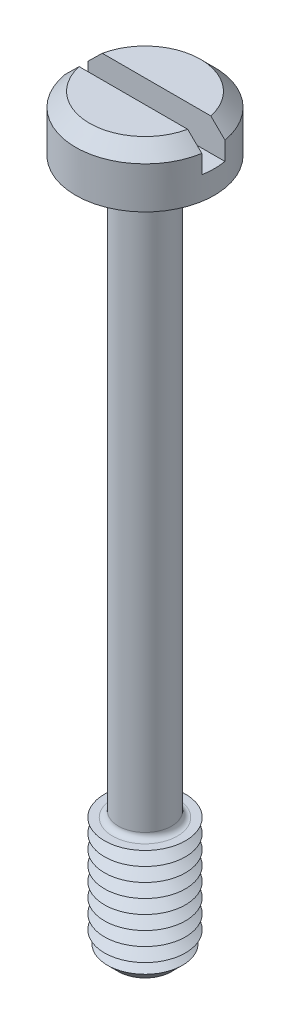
ISO-10303-21;
HEADER;
FILE_DESCRIPTION(('STEP AP214'),'2;1');
FILE_NAME('part.step','',(''),(''),'','','');
FILE_SCHEMA(('AUTOMOTIVE_DESIGN { 1 0 10303 214 1 1 1 1 }'));
ENDSEC;
DATA;
#1=APPLICATION_CONTEXT('core data for automotive mechanical design processes');
#2=APPLICATION_PROTOCOL_DEFINITION('international standard','automotive_design',2000,#1);
#3=PRODUCT_CONTEXT('',#1,'mechanical');
#4=PRODUCT('Part','Part','',(#3));
#5=PRODUCT_RELATED_PRODUCT_CATEGORY('part','',(#4));
#6=PRODUCT_DEFINITION_FORMATION('','',#4);
#7=PRODUCT_DEFINITION_CONTEXT('part definition',#1,'design');
#8=PRODUCT_DEFINITION('design','',#6,#7);
#9=PRODUCT_DEFINITION_SHAPE('','',#8);
#10=(LENGTH_UNIT() NAMED_UNIT(*) SI_UNIT(.MILLI.,.METRE.));
#11=(NAMED_UNIT(*) PLANE_ANGLE_UNIT() SI_UNIT($,.RADIAN.));
#12=(NAMED_UNIT(*) SI_UNIT($,.STERADIAN.) SOLID_ANGLE_UNIT());
#13=UNCERTAINTY_MEASURE_WITH_UNIT(LENGTH_MEASURE(1.E-05),#10,'distance_accuracy_value','');
#14=(GEOMETRIC_REPRESENTATION_CONTEXT(3) GLOBAL_UNCERTAINTY_ASSIGNED_CONTEXT((#13)) GLOBAL_UNIT_ASSIGNED_CONTEXT((#10,
#11,#12)) REPRESENTATION_CONTEXT('',''));
#15=CARTESIAN_POINT('',(0.,0.,0.));
#16=DIRECTION('',(0.,0.,1.));
#17=DIRECTION('',(1.,0.,0.));
#18=AXIS2_PLACEMENT_3D('',#15,#16,#17);
#19=CARTESIAN_POINT('',(0.,2.4,0.));
#20=DIRECTION('',(0.,1.,0.));
#21=DIRECTION('',(0.,0.,1.));
#22=AXIS2_PLACEMENT_3D('',#19,#20,#21);
#23=PLANE('',#22);
#24=DIRECTION('',(-1.,0.,0.));
#25=VECTOR('',#24,1.);
#26=CARTESIAN_POINT('',(3.,2.4,-0.5));
#27=LINE('',#26,#25);
#28=CARTESIAN_POINT('',(2.34733891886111,2.4,-0.5));
#29=VERTEX_POINT('',#28);
#30=CARTESIAN_POINT('',(-2.34733891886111,2.4,-0.5));
#31=VERTEX_POINT('',#30);
#32=EDGE_CURVE('E110',#29,#31,#27,.T.);
#33=ORIENTED_EDGE('',*,*,#32,.F.);
#34=CARTESIAN_POINT('',(0.,2.4,0.));
#35=DIRECTION('',(0.,1.,0.));
#36=DIRECTION('',(0.,0.,1.));
#37=AXIS2_PLACEMENT_3D('',#34,#35,#36);
#38=CIRCLE('',#37,2.40000000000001);
#39=EDGE_CURVE('E113',#29,#31,#38,.T.);
#40=ORIENTED_EDGE('',*,*,#39,.T.);
#41=EDGE_LOOP('',(#33,#40));
#42=FACE_BOUND('',#41,.T.);
#43=ADVANCED_FACE('F39',(#42),#23,.T.);
#44=CARTESIAN_POINT('',(0.,2.4,0.));
#45=DIRECTION('',(0.,-1.,0.));
#46=DIRECTION('',(0.,0.,-1.));
#47=AXIS2_PLACEMENT_3D('',#44,#45,#46);
#48=CONICAL_SURFACE('',#47,2.40000000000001,0.785398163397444);
#49=CARTESIAN_POINT('',(6.59924075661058,-1.81815522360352,-0.5));
#50=CARTESIAN_POINT('',(6.36552831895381,-1.58511655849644,-0.5));
#51=CARTESIAN_POINT('',(6.13178603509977,-1.35210779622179,-0.5));
#52=CARTESIAN_POINT('',(5.66419282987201,-0.886182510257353,-0.5));
#53=CARTESIAN_POINT('',(5.43034190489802,-0.65326599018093,-0.5));
#54=CARTESIAN_POINT('',(4.9622949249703,-0.187370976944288,-0.5));
#55=CARTESIAN_POINT('',(4.72809874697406,0.0456073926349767,-0.5));
#56=CARTESIAN_POINT('',(4.25949632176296,0.51133642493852,-0.5));
#57=CARTESIAN_POINT('',(4.02509008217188,0.744087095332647,-0.5));
#58=CARTESIAN_POINT('',(3.56605462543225,1.19918528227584,-0.5));
#59=CARTESIAN_POINT('',(3.34144041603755,1.42154792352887,-0.5));
#60=CARTESIAN_POINT('',(3.00406693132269,1.75465797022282,-0.5));
#61=CARTESIAN_POINT('',(2.89152775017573,1.86562821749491,-0.5));
#62=CARTESIAN_POINT('',(2.66624137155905,2.08735508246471,-0.5));
#63=CARTESIAN_POINT('',(2.5534941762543,2.19811170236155,-0.5));
#64=CARTESIAN_POINT('',(2.32775708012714,2.41925708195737,-0.5));
#65=CARTESIAN_POINT('',(2.21476734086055,2.52964600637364,-0.5));
#66=CARTESIAN_POINT('',(1.98831594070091,2.74994787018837,-0.5));
#67=CARTESIAN_POINT('',(1.87485426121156,2.85986079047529,-0.5));
#68=CARTESIAN_POINT('',(1.64719242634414,3.07888083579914,-0.5));
#69=CARTESIAN_POINT('',(1.53299241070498,3.18798810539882,-0.5));
#70=CARTESIAN_POINT('',(1.3606375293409,3.3505241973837,-0.5));
#71=CARTESIAN_POINT('',(1.30301197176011,3.40451369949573,-0.5));
#72=CARTESIAN_POINT('',(1.18725070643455,3.51194233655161,-0.5));
#73=CARTESIAN_POINT('',(1.12911501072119,3.56538148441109,-0.5));
#74=CARTESIAN_POINT('',(1.0381044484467,3.64783932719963,-0.5));
#75=CARTESIAN_POINT('',(1.0054935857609,3.67714917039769,-0.5));
#76=CARTESIAN_POINT('',(0.939964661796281,3.73543047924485,-0.5));
#77=CARTESIAN_POINT('',(0.907046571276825,3.76440191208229,-0.5));
#78=CARTESIAN_POINT('',(0.840581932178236,3.82209234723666,-0.5));
#79=CARTESIAN_POINT('',(0.807032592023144,3.8508081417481,-0.5));
#80=CARTESIAN_POINT('',(0.739406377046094,3.90759649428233,-0.5));
#81=CARTESIAN_POINT('',(0.705329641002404,3.93566921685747,-0.5));
#82=CARTESIAN_POINT('',(0.636165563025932,3.99112746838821,-0.5));
#83=CARTESIAN_POINT('',(0.601072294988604,4.01850564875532,-0.5));
#84=CARTESIAN_POINT('',(0.529844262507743,4.07186782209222,-0.5));
#85=CARTESIAN_POINT('',(0.493709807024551,4.09785222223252,-0.5));
#86=CARTESIAN_POINT('',(0.420142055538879,4.14747983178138,-0.5));
#87=CARTESIAN_POINT('',(0.382717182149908,4.17113535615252,-0.5));
#88=CARTESIAN_POINT('',(0.305809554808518,4.21475217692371,-0.5));
#89=CARTESIAN_POINT('',(0.266332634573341,4.23472328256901,-0.5));
#90=CARTESIAN_POINT('',(0.194863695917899,4.2640905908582,-0.5));
#91=CARTESIAN_POINT('',(0.16346702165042,4.27488228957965,-0.5));
#92=CARTESIAN_POINT('',(0.0993951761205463,4.2911465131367,-0.5));
#93=CARTESIAN_POINT('',(0.0667267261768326,4.29664386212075,-0.5));
#94=CARTESIAN_POINT('',(0.000596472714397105,4.30109247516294,-0.5));
#95=CARTESIAN_POINT('',(-0.0328699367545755,4.29998037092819,-0.5));
#96=CARTESIAN_POINT('',(-0.0990204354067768,4.29135963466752,-0.5));
#97=CARTESIAN_POINT('',(-0.131701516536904,4.28382951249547,-0.5));
#98=CARTESIAN_POINT('',(-0.187595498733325,4.26645763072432,-0.5));
#99=CARTESIAN_POINT('',(-0.211151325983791,4.25764794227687,-0.5));
#100=CARTESIAN_POINT('',(-0.257419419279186,4.23801581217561,-0.5));
#101=CARTESIAN_POINT('',(-0.280131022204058,4.22719182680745,-0.5));
#102=CARTESIAN_POINT('',(-0.324887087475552,4.20402808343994,-0.5));
#103=CARTESIAN_POINT('',(-0.346927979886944,4.19168154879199,-0.5));
#104=CARTESIAN_POINT('',(-0.390350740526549,4.16590953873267,-0.5));
#105=CARTESIAN_POINT('',(-0.411732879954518,4.15248451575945,-0.5));
#106=CARTESIAN_POINT('',(-0.48320010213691,4.10572719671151,-0.5));
#107=CARTESIAN_POINT('',(-0.532069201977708,4.07054939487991,-0.5));
#108=CARTESIAN_POINT('',(-0.628034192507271,3.9978371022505,-0.5));
#109=CARTESIAN_POINT('',(-0.675128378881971,3.96030043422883,-0.5));
#110=CARTESIAN_POINT('',(-0.768277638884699,3.8837323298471,-0.5));
#111=CARTESIAN_POINT('',(-0.814329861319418,3.84469743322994,-0.5));
#112=CARTESIAN_POINT('',(-0.905640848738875,3.76575507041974,-0.5));
#113=CARTESIAN_POINT('',(-0.950899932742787,3.72584797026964,-0.5));
#114=CARTESIAN_POINT('',(-1.04097019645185,3.64535266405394,-0.5));
#115=CARTESIAN_POINT('',(-1.08578029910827,3.60476325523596,-0.5));
#116=CARTESIAN_POINT('',(-1.17501433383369,3.52315414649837,-0.5));
#117=CARTESIAN_POINT('',(-1.21943822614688,3.48213440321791,-0.5));
#118=CARTESIAN_POINT('',(-1.35214179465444,3.35874463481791,-0.5));
#119=CARTESIAN_POINT('',(-1.43999477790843,3.27591618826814,-0.5));
#120=CARTESIAN_POINT('',(-1.61421087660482,3.11033648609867,-0.5));
#121=CARTESIAN_POINT('',(-1.70058023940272,3.02759177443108,-0.5));
#122=CARTESIAN_POINT('',(-1.8728892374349,2.86165572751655,-0.5));
#123=CARTESIAN_POINT('',(-1.95882887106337,2.77846439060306,-0.5));
#124=CARTESIAN_POINT('',(-2.21622491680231,2.52844403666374,-0.5));
#125=CARTESIAN_POINT('',(-2.38725269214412,2.36117421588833,-0.5));
#126=CARTESIAN_POINT('',(-2.72882612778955,2.02593191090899,-0.5));
#127=CARTESIAN_POINT('',(-2.89937142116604,1.85795905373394,-0.5));
#128=CARTESIAN_POINT('',(-3.24010524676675,1.52165721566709,-0.5));
#129=CARTESIAN_POINT('',(-3.41029378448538,1.35332824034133,-0.5));
#130=CARTESIAN_POINT('',(-3.7500330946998,1.01685288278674,-0.5));
#131=CARTESIAN_POINT('',(-3.91958441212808,0.848707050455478,-0.5));
#132=CARTESIAN_POINT('',(-4.25853538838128,0.512261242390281,-0.5));
#133=CARTESIAN_POINT('',(-4.42793504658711,0.34396126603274,-0.5));
#134=CARTESIAN_POINT('',(-4.93592097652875,-0.161044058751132,-0.5));
#135=CARTESIAN_POINT('',(-5.27434871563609,-0.497908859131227,-0.5));
#136=CARTESIAN_POINT('',(-5.69486651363,-0.916769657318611,-0.5));
#137=CARTESIAN_POINT('',(-5.77706453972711,-0.998657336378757,-0.5));
#138=CARTESIAN_POINT('',(-5.94145013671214,-1.1624474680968,-0.5));
#139=CARTESIAN_POINT('',(-6.0236377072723,-1.24434992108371,-0.5));
#140=CARTESIAN_POINT('',(-6.18806790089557,-1.40823159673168,-0.5));
#141=CARTESIAN_POINT('',(-6.27031051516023,-1.49021082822,-0.5));
#142=CARTESIAN_POINT('',(-6.43478378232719,-1.65417699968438,-0.5));
#143=CARTESIAN_POINT('',(-6.51701443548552,-1.73616393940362,-0.5));
#144=CARTESIAN_POINT('',(-6.59924075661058,-1.81815522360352,-0.5));
#145=B_SPLINE_CURVE_WITH_KNOTS('',3,(#49,#50,#51,#52,#53,#54,#55,#56,#57,#58,#59,#60,#61,#62,
#63,#64,#65,#66,#67,#68,#69,#70,#71,#72,#73,#74,#75,#76,#77,#78,#79,#80,#81,#82,#83,#84,#85,#86,
#87,#88,#89,#90,#91,#92,#93,#94,#95,#96,#97,#98,#99,#100,#101,#102,#103,#104,#105,#106,#107,
#108,#109,#110,#111,#112,#113,#114,#115,#116,#117,#118,#119,#120,#121,#122,#123,#124,#125,#126,
#127,#128,#129,#130,#131,#132,#133,#134,#135,#136,#137,#138,#139,#140,#141,#142,#143,#144),
.UNSPECIFIED.,.F.,.F.,(4,2,2,2,2,2,2,2,2,2,2,2,2,2,2,2,2,2,2,2,2,2,2,2,2,2,2,2,2,2,2,2,2,2,2,2,
2,2,2,2,2,2,2,2,2,2,2,4),(0.,0.990129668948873,1.98029489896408,2.9713250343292,
3.96232055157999,4.91051293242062,5.38465950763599,5.8588011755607,6.33268991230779,
6.80659750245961,7.28041788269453,7.51731276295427,7.75420207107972,7.88574051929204,
8.01729161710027,8.14976780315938,8.28220970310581,8.41571746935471,8.54918601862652,
8.68190589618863,8.81426715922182,8.91354607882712,9.01235719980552,9.1121171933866,
9.21221254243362,9.28755627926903,9.36295799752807,9.43870832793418,9.51442704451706,
9.69490147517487,9.87554500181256,10.0566343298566,10.2376490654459,10.4190258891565,
10.6004211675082,10.9626397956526,11.3214656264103,11.6802927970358,12.3979711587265,
13.1160968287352,13.8342113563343,14.5505812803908,15.2669541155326,16.6994694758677,
17.0475484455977,17.3956364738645,17.7440040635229,18.0923625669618),.UNSPECIFIED.);
#146=CARTESIAN_POINT('',(2.95803989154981,1.8,-0.5));
#147=VERTEX_POINT('',#146);
#148=EDGE_CURVE('E260',#147,#29,#145,.T.);
#149=ORIENTED_EDGE('',*,*,#148,.F.);
#150=CARTESIAN_POINT('',(0.,1.8,0.));
#151=DIRECTION('',(0.,1.,0.));
#152=DIRECTION('',(0.,0.,1.));
#153=AXIS2_PLACEMENT_3D('',#150,#151,#152);
#154=CIRCLE('',#153,3.);
#155=CARTESIAN_POINT('',(-2.95803989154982,1.8,-0.5));
#156=VERTEX_POINT('',#155);
#157=EDGE_CURVE('E128',#156,#147,#154,.F.);
#158=ORIENTED_EDGE('',*,*,#157,.F.);
#159=EDGE_CURVE('E102',#31,#156,#145,.T.);
#160=ORIENTED_EDGE('',*,*,#159,.F.);
#161=ORIENTED_EDGE('',*,*,#39,.F.);
#162=EDGE_LOOP('',(#149,#158,#160,#161));
#163=FACE_BOUND('',#162,.T.);
#164=ADVANCED_FACE('F222',(#163),#48,.T.);
#165=CARTESIAN_POINT('',(0.,-30.,0.));
#166=DIRECTION('',(0.,1.,0.));
#167=DIRECTION('',(0.,0.,1.));
#168=AXIS2_PLACEMENT_3D('',#165,#166,#167);
#169=CYLINDRICAL_SURFACE('',#168,1.15);
#170=CARTESIAN_POINT('',(0.,-24.55,0.));
#171=DIRECTION('',(0.,-1.,0.));
#172=DIRECTION('',(0.,0.,-1.));
#173=AXIS2_PLACEMENT_3D('',#170,#171,#172);
#174=CIRCLE('',#173,1.15);
#175=CARTESIAN_POINT('',(0.,-24.55,-1.15));
#176=VERTEX_POINT('',#175);
#177=EDGE_CURVE('E123',#176,#176,#174,.F.);
#178=ORIENTED_EDGE('',*,*,#177,.T.);
#179=EDGE_LOOP('',(#178));
#180=FACE_BOUND('',#179,.T.);
#181=CARTESIAN_POINT('',(0.,-0.25,0.));
#182=DIRECTION('',(0.,1.,0.));
#183=DIRECTION('',(0.,0.,1.));
#184=AXIS2_PLACEMENT_3D('',#181,#182,#183);
#185=CIRCLE('',#184,1.15);
#186=CARTESIAN_POINT('',(0.,-0.25,1.15));
#187=VERTEX_POINT('',#186);
#188=EDGE_CURVE('E366',#187,#187,#185,.F.);
#189=ORIENTED_EDGE('',*,*,#188,.T.);
#190=EDGE_LOOP('',(#189));
#191=FACE_BOUND('',#190,.T.);
#192=ADVANCED_FACE('F218',(#180,#191),#169,.T.);
#193=CARTESIAN_POINT('',(0.,2.4,0.));
#194=DIRECTION('',(0.,-1.,0.));
#195=DIRECTION('',(0.,0.,-1.));
#196=AXIS2_PLACEMENT_3D('',#193,#194,#195);
#197=CYLINDRICAL_SURFACE('',#196,3.);
#198=ORIENTED_EDGE('',*,*,#157,.T.);
#199=DIRECTION('',(0.,-1.,0.));
#200=VECTOR('',#199,1.);
#201=CARTESIAN_POINT('',(2.95803989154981,2.4,-0.5));
#202=LINE('',#201,#200);
#203=CARTESIAN_POINT('',(2.95803989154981,1.,-0.5));
#204=VERTEX_POINT('',#203);
#205=EDGE_CURVE('E64',#147,#204,#202,.T.);
#206=ORIENTED_EDGE('',*,*,#205,.T.);
#207=CARTESIAN_POINT('',(0.,1.,0.));
#208=DIRECTION('',(0.,1.,0.));
#209=DIRECTION('',(0.,0.,1.));
#210=AXIS2_PLACEMENT_3D('',#207,#208,#209);
#211=CIRCLE('',#210,3.);
#212=CARTESIAN_POINT('',(2.95803989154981,1.,0.5));
#213=VERTEX_POINT('',#212);
#214=EDGE_CURVE('E11',#213,#204,#211,.T.);
#215=ORIENTED_EDGE('',*,*,#214,.F.);
#216=DIRECTION('',(0.,-1.,0.));
#217=VECTOR('',#216,1.);
#218=CARTESIAN_POINT('',(2.95803989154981,2.4,0.5));
#219=LINE('',#218,#217);
#220=CARTESIAN_POINT('',(2.95803989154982,1.8,0.5));
#221=VERTEX_POINT('',#220);
#222=EDGE_CURVE('E278',#213,#221,#219,.F.);
#223=ORIENTED_EDGE('',*,*,#222,.T.);
#224=CARTESIAN_POINT('',(-2.95803989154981,1.8,0.5));
#225=VERTEX_POINT('',#224);
#226=EDGE_CURVE('E120',#221,#225,#154,.F.);
#227=ORIENTED_EDGE('',*,*,#226,.T.);
#228=DIRECTION('',(0.,-1.,0.));
#229=VECTOR('',#228,1.);
#230=CARTESIAN_POINT('',(-2.95803989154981,2.4,0.5));
#231=LINE('',#230,#229);
#232=CARTESIAN_POINT('',(-2.95803989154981,1.,0.5));
#233=VERTEX_POINT('',#232);
#234=EDGE_CURVE('E96',#225,#233,#231,.T.);
#235=ORIENTED_EDGE('',*,*,#234,.T.);
#236=CARTESIAN_POINT('',(-2.95803989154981,1.,-0.5));
#237=VERTEX_POINT('',#236);
#238=EDGE_CURVE('E44',#237,#233,#211,.T.);
#239=ORIENTED_EDGE('',*,*,#238,.F.);
#240=DIRECTION('',(0.,-1.,0.));
#241=VECTOR('',#240,1.);
#242=CARTESIAN_POINT('',(-2.95803989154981,2.4,-0.5));
#243=LINE('',#242,#241);
#244=EDGE_CURVE('E283',#237,#156,#243,.F.);
#245=ORIENTED_EDGE('',*,*,#244,.T.);
#246=EDGE_LOOP('',(#198,#206,#215,#223,#227,#235,#239,#245));
#247=FACE_BOUND('',#246,.T.);
#248=CARTESIAN_POINT('',(0.,0.,0.));
#249=DIRECTION('',(0.,1.,0.));
#250=DIRECTION('',(0.,0.,1.));
#251=AXIS2_PLACEMENT_3D('',#248,#249,#250);
#252=CIRCLE('',#251,3.);
#253=CARTESIAN_POINT('',(0.,0.,3.));
#254=VERTEX_POINT('',#253);
#255=EDGE_CURVE('E353',#254,#254,#252,.T.);
#256=ORIENTED_EDGE('',*,*,#255,.T.);
#257=EDGE_LOOP('',(#256));
#258=FACE_BOUND('',#257,.T.);
#259=ADVANCED_FACE('F221',(#247,#258),#197,.T.);
#260=DIRECTION('',(1.,0.,0.));
#261=VECTOR('',#260,1.);
#262=CARTESIAN_POINT('',(3.,2.4,0.5));
#263=LINE('',#262,#261);
#264=CARTESIAN_POINT('',(-2.34733891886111,2.4,0.5));
#265=VERTEX_POINT('',#264);
#266=CARTESIAN_POINT('',(2.34733891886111,2.4,0.5));
#267=VERTEX_POINT('',#266);
#268=EDGE_CURVE('E56',#265,#267,#263,.T.);
#269=ORIENTED_EDGE('',*,*,#268,.F.);
#270=EDGE_CURVE('E108',#265,#267,#38,.T.);
#271=ORIENTED_EDGE('',*,*,#270,.T.);
#272=EDGE_LOOP('',(#269,#271));
#273=FACE_BOUND('',#272,.T.);
#274=ADVANCED_FACE('F107',(#273),#23,.T.);
#275=CARTESIAN_POINT('',(0.,0.,0.));
#276=DIRECTION('',(0.,1.,0.));
#277=DIRECTION('',(0.,0.,1.));
#278=AXIS2_PLACEMENT_3D('',#275,#276,#277);
#279=PLANE('',#278);
#280=CARTESIAN_POINT('',(0.,0.,0.));
#281=DIRECTION('',(0.,1.,0.));
#282=DIRECTION('',(0.,0.,1.));
#283=AXIS2_PLACEMENT_3D('',#280,#281,#282);
#284=CIRCLE('',#283,1.4);
#285=CARTESIAN_POINT('',(0.,0.,1.4));
#286=VERTEX_POINT('',#285);
#287=EDGE_CURVE('E114',#286,#286,#284,.T.);
#288=ORIENTED_EDGE('',*,*,#287,.T.);
#289=EDGE_LOOP('',(#288));
#290=FACE_BOUND('',#289,.T.);
#291=ORIENTED_EDGE('',*,*,#255,.F.);
#292=EDGE_LOOP('',(#291));
#293=FACE_BOUND('',#292,.T.);
#294=ADVANCED_FACE('F212',(#290,#293),#279,.F.);
#295=CARTESIAN_POINT('',(0.,-24.8,0.));
#296=DIRECTION('',(0.,-1.,0.));
#297=DIRECTION('',(0.,0.,-1.));
#298=AXIS2_PLACEMENT_3D('',#295,#296,#297);
#299=PLANE('',#298);
#300=CARTESIAN_POINT('',(0.,-24.8,0.));
#301=DIRECTION('',(0.,-1.,0.));
#302=DIRECTION('',(0.,0.,-1.));
#303=AXIS2_PLACEMENT_3D('',#300,#301,#302);
#304=CIRCLE('',#303,1.4);
#305=CARTESIAN_POINT('',(0.,-24.8,-1.4));
#306=VERTEX_POINT('',#305);
#307=EDGE_CURVE('E360',#306,#306,#304,.T.);
#308=ORIENTED_EDGE('',*,*,#307,.T.);
#309=EDGE_LOOP('',(#308));
#310=FACE_BOUND('',#309,.T.);
#311=CARTESIAN_POINT('',(0.,-24.8,0.));
#312=DIRECTION('',(0.,1.,0.));
#313=DIRECTION('',(0.,0.,1.));
#314=AXIS2_PLACEMENT_3D('',#311,#312,#313);
#315=CIRCLE('',#314,1.75);
#316=CARTESIAN_POINT('',(0.,-24.8,1.75));
#317=VERTEX_POINT('',#316);
#318=EDGE_CURVE('E349',#317,#317,#315,.T.);
#319=ORIENTED_EDGE('',*,*,#318,.T.);
#320=EDGE_LOOP('',(#319));
#321=FACE_BOUND('',#320,.T.);
#322=ADVANCED_FACE('F208',(#310,#321),#299,.F.);
#323=CARTESIAN_POINT('',(0.,-25.1,0.));
#324=DIRECTION('',(0.,1.,0.));
#325=DIRECTION('',(0.,0.,1.));
#326=AXIS2_PLACEMENT_3D('',#323,#324,#325);
#327=CONICAL_SURFACE('',#326,1.23038475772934,1.0471975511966);
#328=ORIENTED_EDGE('',*,*,#318,.F.);
#329=EDGE_LOOP('',(#328));
#330=FACE_BOUND('',#329,.T.);
#331=CARTESIAN_POINT('',(0.,-25.1,0.));
#332=DIRECTION('',(0.,1.,0.));
#333=DIRECTION('',(0.,0.,1.));
#334=AXIS2_PLACEMENT_3D('',#331,#332,#333);
#335=CIRCLE('',#334,1.23038475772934);
#336=CARTESIAN_POINT('',(0.,-25.1,1.23038475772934));
#337=VERTEX_POINT('',#336);
#338=EDGE_CURVE('E346',#337,#337,#335,.T.);
#339=ORIENTED_EDGE('',*,*,#338,.T.);
#340=EDGE_LOOP('',(#339));
#341=FACE_BOUND('',#340,.T.);
#342=ADVANCED_FACE('F204',(#330,#341),#327,.T.);
#343=CARTESIAN_POINT('',(0.,-25.4,0.));
#344=DIRECTION('',(0.,-1.,0.));
#345=DIRECTION('',(0.,0.,-1.));
#346=AXIS2_PLACEMENT_3D('',#343,#344,#345);
#347=CONICAL_SURFACE('',#346,1.75,1.0471975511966);
#348=ORIENTED_EDGE('',*,*,#338,.F.);
#349=EDGE_LOOP('',(#348));
#350=FACE_BOUND('',#349,.T.);
#351=CARTESIAN_POINT('',(0.,-25.4,0.));
#352=DIRECTION('',(0.,1.,0.));
#353=DIRECTION('',(0.,0.,1.));
#354=AXIS2_PLACEMENT_3D('',#351,#352,#353);
#355=CIRCLE('',#354,1.75);
#356=CARTESIAN_POINT('',(0.,-25.4,1.75));
#357=VERTEX_POINT('',#356);
#358=EDGE_CURVE('E342',#357,#357,#355,.T.);
#359=ORIENTED_EDGE('',*,*,#358,.T.);
#360=EDGE_LOOP('',(#359));
#361=FACE_BOUND('',#360,.T.);
#362=ADVANCED_FACE('F200',(#350,#361),#347,.T.);
#363=CARTESIAN_POINT('',(0.,-25.7,0.));
#364=DIRECTION('',(0.,1.,0.));
#365=DIRECTION('',(0.,0.,1.));
#366=AXIS2_PLACEMENT_3D('',#363,#364,#365);
#367=CONICAL_SURFACE('',#366,1.23038475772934,1.0471975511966);
#368=ORIENTED_EDGE('',*,*,#358,.F.);
#369=EDGE_LOOP('',(#368));
#370=FACE_BOUND('',#369,.T.);
#371=CARTESIAN_POINT('',(0.,-25.7,0.));
#372=DIRECTION('',(0.,1.,0.));
#373=DIRECTION('',(0.,0.,1.));
#374=AXIS2_PLACEMENT_3D('',#371,#372,#373);
#375=CIRCLE('',#374,1.23038475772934);
#376=CARTESIAN_POINT('',(0.,-25.7,1.23038475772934));
#377=VERTEX_POINT('',#376);
#378=EDGE_CURVE('E338',#377,#377,#375,.T.);
#379=ORIENTED_EDGE('',*,*,#378,.T.);
#380=EDGE_LOOP('',(#379));
#381=FACE_BOUND('',#380,.T.);
#382=ADVANCED_FACE('F196',(#370,#381),#367,.T.);
#383=CARTESIAN_POINT('',(0.,-26.,0.));
#384=DIRECTION('',(0.,-1.,0.));
#385=DIRECTION('',(0.,0.,-1.));
#386=AXIS2_PLACEMENT_3D('',#383,#384,#385);
#387=CONICAL_SURFACE('',#386,1.75,1.0471975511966);
#388=ORIENTED_EDGE('',*,*,#378,.F.);
#389=EDGE_LOOP('',(#388));
#390=FACE_BOUND('',#389,.T.);
#391=CARTESIAN_POINT('',(0.,-26.,0.));
#392=DIRECTION('',(0.,1.,0.));
#393=DIRECTION('',(0.,0.,1.));
#394=AXIS2_PLACEMENT_3D('',#391,#392,#393);
#395=CIRCLE('',#394,1.75);
#396=CARTESIAN_POINT('',(0.,-26.,1.75));
#397=VERTEX_POINT('',#396);
#398=EDGE_CURVE('E334',#397,#397,#395,.T.);
#399=ORIENTED_EDGE('',*,*,#398,.T.);
#400=EDGE_LOOP('',(#399));
#401=FACE_BOUND('',#400,.T.);
#402=ADVANCED_FACE('F192',(#390,#401),#387,.T.);
#403=CARTESIAN_POINT('',(0.,-26.3,0.));
#404=DIRECTION('',(0.,1.,0.));
#405=DIRECTION('',(0.,0.,1.));
#406=AXIS2_PLACEMENT_3D('',#403,#404,#405);
#407=CONICAL_SURFACE('',#406,1.23038475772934,1.0471975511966);
#408=ORIENTED_EDGE('',*,*,#398,.F.);
#409=EDGE_LOOP('',(#408));
#410=FACE_BOUND('',#409,.T.);
#411=CARTESIAN_POINT('',(0.,-26.3,0.));
#412=DIRECTION('',(0.,1.,0.));
#413=DIRECTION('',(0.,0.,1.));
#414=AXIS2_PLACEMENT_3D('',#411,#412,#413);
#415=CIRCLE('',#414,1.23038475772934);
#416=CARTESIAN_POINT('',(0.,-26.3,1.23038475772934));
#417=VERTEX_POINT('',#416);
#418=EDGE_CURVE('E330',#417,#417,#415,.T.);
#419=ORIENTED_EDGE('',*,*,#418,.T.);
#420=EDGE_LOOP('',(#419));
#421=FACE_BOUND('',#420,.T.);
#422=ADVANCED_FACE('F188',(#410,#421),#407,.T.);
#423=CARTESIAN_POINT('',(0.,-26.6,0.));
#424=DIRECTION('',(0.,-1.,0.));
#425=DIRECTION('',(0.,0.,-1.));
#426=AXIS2_PLACEMENT_3D('',#423,#424,#425);
#427=CONICAL_SURFACE('',#426,1.75,1.0471975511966);
#428=ORIENTED_EDGE('',*,*,#418,.F.);
#429=EDGE_LOOP('',(#428));
#430=FACE_BOUND('',#429,.T.);
#431=CARTESIAN_POINT('',(0.,-26.6,0.));
#432=DIRECTION('',(0.,1.,0.));
#433=DIRECTION('',(0.,0.,1.));
#434=AXIS2_PLACEMENT_3D('',#431,#432,#433);
#435=CIRCLE('',#434,1.75);
#436=CARTESIAN_POINT('',(0.,-26.6,1.75));
#437=VERTEX_POINT('',#436);
#438=EDGE_CURVE('E326',#437,#437,#435,.T.);
#439=ORIENTED_EDGE('',*,*,#438,.T.);
#440=EDGE_LOOP('',(#439));
#441=FACE_BOUND('',#440,.T.);
#442=ADVANCED_FACE('F184',(#430,#441),#427,.T.);
#443=CARTESIAN_POINT('',(0.,-26.9,0.));
#444=DIRECTION('',(0.,1.,0.));
#445=DIRECTION('',(0.,0.,1.));
#446=AXIS2_PLACEMENT_3D('',#443,#444,#445);
#447=CONICAL_SURFACE('',#446,1.23038475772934,1.0471975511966);
#448=ORIENTED_EDGE('',*,*,#438,.F.);
#449=EDGE_LOOP('',(#448));
#450=FACE_BOUND('',#449,.T.);
#451=CARTESIAN_POINT('',(0.,-26.9,0.));
#452=DIRECTION('',(0.,1.,0.));
#453=DIRECTION('',(0.,0.,1.));
#454=AXIS2_PLACEMENT_3D('',#451,#452,#453);
#455=CIRCLE('',#454,1.23038475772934);
#456=CARTESIAN_POINT('',(0.,-26.9,1.23038475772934));
#457=VERTEX_POINT('',#456);
#458=EDGE_CURVE('E323',#457,#457,#455,.T.);
#459=ORIENTED_EDGE('',*,*,#458,.T.);
#460=EDGE_LOOP('',(#459));
#461=FACE_BOUND('',#460,.T.);
#462=ADVANCED_FACE('F180',(#450,#461),#447,.T.);
#463=CARTESIAN_POINT('',(0.,-27.2,0.));
#464=DIRECTION('',(0.,-1.,0.));
#465=DIRECTION('',(0.,0.,-1.));
#466=AXIS2_PLACEMENT_3D('',#463,#464,#465);
#467=CONICAL_SURFACE('',#466,1.75,1.0471975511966);
#468=ORIENTED_EDGE('',*,*,#458,.F.);
#469=EDGE_LOOP('',(#468));
#470=FACE_BOUND('',#469,.T.);
#471=CARTESIAN_POINT('',(0.,-27.2,0.));
#472=DIRECTION('',(0.,1.,0.));
#473=DIRECTION('',(0.,0.,1.));
#474=AXIS2_PLACEMENT_3D('',#471,#472,#473);
#475=CIRCLE('',#474,1.75);
#476=CARTESIAN_POINT('',(0.,-27.2,1.75));
#477=VERTEX_POINT('',#476);
#478=EDGE_CURVE('E320',#477,#477,#475,.T.);
#479=ORIENTED_EDGE('',*,*,#478,.T.);
#480=EDGE_LOOP('',(#479));
#481=FACE_BOUND('',#480,.T.);
#482=ADVANCED_FACE('F176',(#470,#481),#467,.T.);
#483=CARTESIAN_POINT('',(0.,-27.5,0.));
#484=DIRECTION('',(0.,1.,0.));
#485=DIRECTION('',(0.,0.,1.));
#486=AXIS2_PLACEMENT_3D('',#483,#484,#485);
#487=CONICAL_SURFACE('',#486,1.23038475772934,1.0471975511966);
#488=ORIENTED_EDGE('',*,*,#478,.F.);
#489=EDGE_LOOP('',(#488));
#490=FACE_BOUND('',#489,.T.);
#491=CARTESIAN_POINT('',(0.,-27.5,0.));
#492=DIRECTION('',(0.,1.,0.));
#493=DIRECTION('',(0.,0.,1.));
#494=AXIS2_PLACEMENT_3D('',#491,#492,#493);
#495=CIRCLE('',#494,1.23038475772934);
#496=CARTESIAN_POINT('',(0.,-27.5,1.23038475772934));
#497=VERTEX_POINT('',#496);
#498=EDGE_CURVE('E317',#497,#497,#495,.T.);
#499=ORIENTED_EDGE('',*,*,#498,.T.);
#500=EDGE_LOOP('',(#499));
#501=FACE_BOUND('',#500,.T.);
#502=ADVANCED_FACE('F172',(#490,#501),#487,.T.);
#503=CARTESIAN_POINT('',(0.,-27.8,0.));
#504=DIRECTION('',(0.,-1.,0.));
#505=DIRECTION('',(0.,0.,-1.));
#506=AXIS2_PLACEMENT_3D('',#503,#504,#505);
#507=CONICAL_SURFACE('',#506,1.75,1.0471975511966);
#508=ORIENTED_EDGE('',*,*,#498,.F.);
#509=EDGE_LOOP('',(#508));
#510=FACE_BOUND('',#509,.T.);
#511=CARTESIAN_POINT('',(0.,-27.8,0.));
#512=DIRECTION('',(0.,1.,0.));
#513=DIRECTION('',(0.,0.,1.));
#514=AXIS2_PLACEMENT_3D('',#511,#512,#513);
#515=CIRCLE('',#514,1.75);
#516=CARTESIAN_POINT('',(0.,-27.8,1.75));
#517=VERTEX_POINT('',#516);
#518=EDGE_CURVE('E313',#517,#517,#515,.T.);
#519=ORIENTED_EDGE('',*,*,#518,.T.);
#520=EDGE_LOOP('',(#519));
#521=FACE_BOUND('',#520,.T.);
#522=ADVANCED_FACE('F168',(#510,#521),#507,.T.);
#523=CARTESIAN_POINT('',(0.,-28.1,0.));
#524=DIRECTION('',(0.,1.,0.));
#525=DIRECTION('',(0.,0.,1.));
#526=AXIS2_PLACEMENT_3D('',#523,#524,#525);
#527=CONICAL_SURFACE('',#526,1.23038475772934,1.0471975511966);
#528=ORIENTED_EDGE('',*,*,#518,.F.);
#529=EDGE_LOOP('',(#528));
#530=FACE_BOUND('',#529,.T.);
#531=CARTESIAN_POINT('',(0.,-28.1,0.));
#532=DIRECTION('',(0.,1.,0.));
#533=DIRECTION('',(0.,0.,1.));
#534=AXIS2_PLACEMENT_3D('',#531,#532,#533);
#535=CIRCLE('',#534,1.23038475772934);
#536=CARTESIAN_POINT('',(0.,-28.1,1.23038475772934));
#537=VERTEX_POINT('',#536);
#538=EDGE_CURVE('E310',#537,#537,#535,.T.);
#539=ORIENTED_EDGE('',*,*,#538,.T.);
#540=EDGE_LOOP('',(#539));
#541=FACE_BOUND('',#540,.T.);
#542=ADVANCED_FACE('F164',(#530,#541),#527,.T.);
#543=CARTESIAN_POINT('',(0.,-28.4,0.));
#544=DIRECTION('',(0.,-1.,0.));
#545=DIRECTION('',(0.,0.,-1.));
#546=AXIS2_PLACEMENT_3D('',#543,#544,#545);
#547=CONICAL_SURFACE('',#546,1.75,1.0471975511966);
#548=ORIENTED_EDGE('',*,*,#538,.F.);
#549=EDGE_LOOP('',(#548));
#550=FACE_BOUND('',#549,.T.);
#551=CARTESIAN_POINT('',(0.,-28.4,0.));
#552=DIRECTION('',(0.,1.,0.));
#553=DIRECTION('',(0.,0.,1.));
#554=AXIS2_PLACEMENT_3D('',#551,#552,#553);
#555=CIRCLE('',#554,1.75);
#556=CARTESIAN_POINT('',(0.,-28.4,1.75));
#557=VERTEX_POINT('',#556);
#558=EDGE_CURVE('E306',#557,#557,#555,.T.);
#559=ORIENTED_EDGE('',*,*,#558,.T.);
#560=EDGE_LOOP('',(#559));
#561=FACE_BOUND('',#560,.T.);
#562=ADVANCED_FACE('F160',(#550,#561),#547,.T.);
#563=CARTESIAN_POINT('',(0.,-28.7,0.));
#564=DIRECTION('',(0.,1.,0.));
#565=DIRECTION('',(0.,0.,1.));
#566=AXIS2_PLACEMENT_3D('',#563,#564,#565);
#567=CONICAL_SURFACE('',#566,1.23038475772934,1.0471975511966);
#568=ORIENTED_EDGE('',*,*,#558,.F.);
#569=EDGE_LOOP('',(#568));
#570=FACE_BOUND('',#569,.T.);
#571=CARTESIAN_POINT('',(0.,-28.7,0.));
#572=DIRECTION('',(0.,1.,0.));
#573=DIRECTION('',(0.,0.,1.));
#574=AXIS2_PLACEMENT_3D('',#571,#572,#573);
#575=CIRCLE('',#574,1.23038475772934);
#576=CARTESIAN_POINT('',(0.,-28.7,1.23038475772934));
#577=VERTEX_POINT('',#576);
#578=EDGE_CURVE('E302',#577,#577,#575,.T.);
#579=ORIENTED_EDGE('',*,*,#578,.T.);
#580=EDGE_LOOP('',(#579));
#581=FACE_BOUND('',#580,.T.);
#582=ADVANCED_FACE('F156',(#570,#581),#567,.T.);
#583=CARTESIAN_POINT('',(0.,-29.,0.));
#584=DIRECTION('',(0.,-1.,0.));
#585=DIRECTION('',(0.,0.,-1.));
#586=AXIS2_PLACEMENT_3D('',#583,#584,#585);
#587=CONICAL_SURFACE('',#586,1.75,1.0471975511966);
#588=ORIENTED_EDGE('',*,*,#578,.F.);
#589=EDGE_LOOP('',(#588));
#590=FACE_BOUND('',#589,.T.);
#591=CARTESIAN_POINT('',(0.,-29.,0.));
#592=DIRECTION('',(0.,1.,0.));
#593=DIRECTION('',(0.,0.,1.));
#594=AXIS2_PLACEMENT_3D('',#591,#592,#593);
#595=CIRCLE('',#594,1.75);
#596=CARTESIAN_POINT('',(0.,-29.,1.75));
#597=VERTEX_POINT('',#596);
#598=EDGE_CURVE('E298',#597,#597,#595,.T.);
#599=ORIENTED_EDGE('',*,*,#598,.T.);
#600=EDGE_LOOP('',(#599));
#601=FACE_BOUND('',#600,.T.);
#602=ADVANCED_FACE('F152',(#590,#601),#587,.T.);
#603=CARTESIAN_POINT('',(0.,-29.3,0.));
#604=DIRECTION('',(0.,1.,0.));
#605=DIRECTION('',(0.,0.,1.));
#606=AXIS2_PLACEMENT_3D('',#603,#604,#605);
#607=CONICAL_SURFACE('',#606,1.23038475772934,1.0471975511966);
#608=ORIENTED_EDGE('',*,*,#598,.F.);
#609=EDGE_LOOP('',(#608));
#610=FACE_BOUND('',#609,.T.);
#611=CARTESIAN_POINT('',(0.,-29.3,0.));
#612=DIRECTION('',(0.,1.,0.));
#613=DIRECTION('',(0.,0.,1.));
#614=AXIS2_PLACEMENT_3D('',#611,#612,#613);
#615=CIRCLE('',#614,1.23038475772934);
#616=CARTESIAN_POINT('',(0.,-29.3,1.23038475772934));
#617=VERTEX_POINT('',#616);
#618=EDGE_CURVE('E294',#617,#617,#615,.T.);
#619=ORIENTED_EDGE('',*,*,#618,.T.);
#620=EDGE_LOOP('',(#619));
#621=FACE_BOUND('',#620,.T.);
#622=ADVANCED_FACE('F148',(#610,#621),#607,.T.);
#623=CARTESIAN_POINT('',(0.,-29.6,0.));
#624=DIRECTION('',(0.,-1.,0.));
#625=DIRECTION('',(0.,0.,-1.));
#626=AXIS2_PLACEMENT_3D('',#623,#624,#625);
#627=CONICAL_SURFACE('',#626,1.75,1.0471975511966);
#628=CARTESIAN_POINT('',(0.,-29.5267949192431,0.));
#629=DIRECTION('',(0.,-1.,0.));
#630=DIRECTION('',(0.,0.,-1.));
#631=AXIS2_PLACEMENT_3D('',#628,#629,#630);
#632=CIRCLE('',#631,1.62320508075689);
#633=CARTESIAN_POINT('',(0.,-29.5267949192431,-1.62320508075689));
#634=VERTEX_POINT('',#633);
#635=EDGE_CURVE('E301',#634,#634,#632,.F.);
#636=ORIENTED_EDGE('',*,*,#635,.T.);
#637=EDGE_LOOP('',(#636));
#638=FACE_BOUND('',#637,.T.);
#639=ORIENTED_EDGE('',*,*,#618,.F.);
#640=EDGE_LOOP('',(#639));
#641=FACE_BOUND('',#640,.T.);
#642=ADVANCED_FACE('F144',(#638,#641),#627,.T.);
#643=CARTESIAN_POINT('',(0.,-30.,0.));
#644=DIRECTION('',(0.,-1.,0.));
#645=DIRECTION('',(0.,0.,-1.));
#646=AXIS2_PLACEMENT_3D('',#643,#644,#645);
#647=PLANE('',#646);
#648=CARTESIAN_POINT('',(0.,-30.,0.));
#649=DIRECTION('',(0.,-1.,0.));
#650=DIRECTION('',(0.,0.,-1.));
#651=AXIS2_PLACEMENT_3D('',#648,#649,#650);
#652=CIRCLE('',#651,1.15000000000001);
#653=CARTESIAN_POINT('',(0.,-30.,-1.15000000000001));
#654=VERTEX_POINT('',#653);
#655=EDGE_CURVE('E356',#654,#654,#652,.T.);
#656=ORIENTED_EDGE('',*,*,#655,.T.);
#657=EDGE_LOOP('',(#656));
#658=FACE_BOUND('',#657,.T.);
#659=ADVANCED_FACE('F147',(#658),#647,.T.);
#660=CARTESIAN_POINT('',(0.,-30.,0.));
#661=DIRECTION('',(0.,1.,0.));
#662=DIRECTION('',(0.,0.,1.));
#663=AXIS2_PLACEMENT_3D('',#660,#661,#662);
#664=CONICAL_SURFACE('',#663,1.15000000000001,0.785398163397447);
#665=ORIENTED_EDGE('',*,*,#635,.F.);
#666=EDGE_LOOP('',(#665));
#667=FACE_BOUND('',#666,.T.);
#668=ORIENTED_EDGE('',*,*,#655,.F.);
#669=EDGE_LOOP('',(#668));
#670=FACE_BOUND('',#669,.T.);
#671=ADVANCED_FACE('F216',(#667,#670),#664,.T.);
#672=CARTESIAN_POINT('',(0.,-24.55,0.));
#673=DIRECTION('',(0.,-1.,0.));
#674=DIRECTION('',(0.,0.,-1.));
#675=AXIS2_PLACEMENT_3D('',#672,#673,#674);
#676=TOROIDAL_SURFACE('',#675,1.4,0.25);
#677=ORIENTED_EDGE('',*,*,#177,.F.);
#678=EDGE_LOOP('',(#677));
#679=FACE_BOUND('',#678,.T.);
#680=ORIENTED_EDGE('',*,*,#307,.F.);
#681=EDGE_LOOP('',(#680));
#682=FACE_BOUND('',#681,.T.);
#683=ADVANCED_FACE('F234',(#679,#682),#676,.F.);
#684=CARTESIAN_POINT('',(0.,-0.25,0.));
#685=DIRECTION('',(0.,1.,0.));
#686=DIRECTION('',(0.,0.,1.));
#687=AXIS2_PLACEMENT_3D('',#684,#685,#686);
#688=TOROIDAL_SURFACE('',#687,1.4,0.25);
#689=ORIENTED_EDGE('',*,*,#287,.F.);
#690=EDGE_LOOP('',(#689));
#691=FACE_BOUND('',#690,.T.);
#692=ORIENTED_EDGE('',*,*,#188,.F.);
#693=EDGE_LOOP('',(#692));
#694=FACE_BOUND('',#693,.T.);
#695=ADVANCED_FACE('F237',(#691,#694),#688,.F.);
#696=CARTESIAN_POINT('',(-6.59924075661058,-1.81815522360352,0.5));
#697=CARTESIAN_POINT('',(-6.36552831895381,-1.58511655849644,0.5));
#698=CARTESIAN_POINT('',(-6.13178603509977,-1.35210779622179,0.5));
#699=CARTESIAN_POINT('',(-5.66419282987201,-0.88618251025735,0.5));
#700=CARTESIAN_POINT('',(-5.43034190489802,-0.653265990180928,0.5));
#701=CARTESIAN_POINT('',(-4.9622949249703,-0.187370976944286,0.5));
#702=CARTESIAN_POINT('',(-4.72809874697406,0.0456073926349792,0.5));
#703=CARTESIAN_POINT('',(-4.25949632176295,0.511336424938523,0.5));
#704=CARTESIAN_POINT('',(-4.02509008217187,0.74408709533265,0.5));
#705=CARTESIAN_POINT('',(-3.56605462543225,1.19918528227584,0.5));
#706=CARTESIAN_POINT('',(-3.34144041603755,1.42154792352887,0.5));
#707=CARTESIAN_POINT('',(-3.00406693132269,1.75465797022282,0.5));
#708=CARTESIAN_POINT('',(-2.89152775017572,1.86562821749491,0.5));
#709=CARTESIAN_POINT('',(-2.66624137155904,2.08735508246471,0.5));
#710=CARTESIAN_POINT('',(-2.5534941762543,2.19811170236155,0.5));
#711=CARTESIAN_POINT('',(-2.32775708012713,2.41925708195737,0.5));
#712=CARTESIAN_POINT('',(-2.21476734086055,2.52964600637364,0.5));
#713=CARTESIAN_POINT('',(-1.98831594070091,2.74994787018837,0.5));
#714=CARTESIAN_POINT('',(-1.87485426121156,2.85986079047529,0.5));
#715=CARTESIAN_POINT('',(-1.64719242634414,3.07888083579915,0.5));
#716=CARTESIAN_POINT('',(-1.53299241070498,3.18798810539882,0.5));
#717=CARTESIAN_POINT('',(-1.3606375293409,3.3505241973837,0.5));
#718=CARTESIAN_POINT('',(-1.30301197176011,3.40451369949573,0.5));
#719=CARTESIAN_POINT('',(-1.18725070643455,3.51194233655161,0.5));
#720=CARTESIAN_POINT('',(-1.12911501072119,3.56538148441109,0.5));
#721=CARTESIAN_POINT('',(-1.0381044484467,3.64783932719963,0.5));
#722=CARTESIAN_POINT('',(-1.0054935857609,3.67714917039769,0.5));
#723=CARTESIAN_POINT('',(-0.939964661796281,3.73543047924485,0.5));
#724=CARTESIAN_POINT('',(-0.907046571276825,3.76440191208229,0.5));
#725=CARTESIAN_POINT('',(-0.840581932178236,3.82209234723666,0.5));
#726=CARTESIAN_POINT('',(-0.807032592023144,3.8508081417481,0.5));
#727=CARTESIAN_POINT('',(-0.739406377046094,3.90759649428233,0.5));
#728=CARTESIAN_POINT('',(-0.705329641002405,3.93566921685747,0.5));
#729=CARTESIAN_POINT('',(-0.636165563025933,3.99112746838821,0.5));
#730=CARTESIAN_POINT('',(-0.601072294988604,4.01850564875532,0.5));
#731=CARTESIAN_POINT('',(-0.529844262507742,4.07186782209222,0.5));
#732=CARTESIAN_POINT('',(-0.49370980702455,4.09785222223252,0.5));
#733=CARTESIAN_POINT('',(-0.420142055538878,4.14747983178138,0.5));
#734=CARTESIAN_POINT('',(-0.382717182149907,4.17113535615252,0.5));
#735=CARTESIAN_POINT('',(-0.305809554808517,4.21475217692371,0.5));
#736=CARTESIAN_POINT('',(-0.266332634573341,4.23472328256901,0.5));
#737=CARTESIAN_POINT('',(-0.194863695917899,4.2640905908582,0.5));
#738=CARTESIAN_POINT('',(-0.16346702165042,4.27488228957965,0.5));
#739=CARTESIAN_POINT('',(-0.0993951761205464,4.2911465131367,0.5));
#740=CARTESIAN_POINT('',(-0.0667267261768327,4.29664386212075,0.5));
#741=CARTESIAN_POINT('',(-0.000596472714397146,4.30109247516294,0.5));
#742=CARTESIAN_POINT('',(0.0328699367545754,4.29998037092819,0.5));
#743=CARTESIAN_POINT('',(0.0990204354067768,4.29135963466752,0.5));
#744=CARTESIAN_POINT('',(0.131701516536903,4.28382951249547,0.5));
#745=CARTESIAN_POINT('',(0.187595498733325,4.26645763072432,0.5));
#746=CARTESIAN_POINT('',(0.211151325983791,4.25764794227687,0.5));
#747=CARTESIAN_POINT('',(0.257419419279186,4.23801581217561,0.5));
#748=CARTESIAN_POINT('',(0.280131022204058,4.22719182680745,0.5));
#749=CARTESIAN_POINT('',(0.324887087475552,4.20402808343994,0.5));
#750=CARTESIAN_POINT('',(0.346927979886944,4.19168154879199,0.5));
#751=CARTESIAN_POINT('',(0.390350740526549,4.16590953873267,0.5));
#752=CARTESIAN_POINT('',(0.411732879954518,4.15248451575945,0.5));
#753=CARTESIAN_POINT('',(0.483200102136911,4.10572719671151,0.5));
#754=CARTESIAN_POINT('',(0.532069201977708,4.07054939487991,0.5));
#755=CARTESIAN_POINT('',(0.628034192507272,3.9978371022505,0.5));
#756=CARTESIAN_POINT('',(0.675128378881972,3.96030043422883,0.5));
#757=CARTESIAN_POINT('',(0.768277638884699,3.8837323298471,0.5));
#758=CARTESIAN_POINT('',(0.814329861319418,3.84469743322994,0.5));
#759=CARTESIAN_POINT('',(0.905640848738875,3.76575507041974,0.5));
#760=CARTESIAN_POINT('',(0.950899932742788,3.72584797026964,0.5));
#761=CARTESIAN_POINT('',(1.04097019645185,3.64535266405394,0.5));
#762=CARTESIAN_POINT('',(1.08578029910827,3.60476325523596,0.5));
#763=CARTESIAN_POINT('',(1.17501433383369,3.52315414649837,0.5));
#764=CARTESIAN_POINT('',(1.21943822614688,3.48213440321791,0.5));
#765=CARTESIAN_POINT('',(1.35214179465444,3.35874463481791,0.5));
#766=CARTESIAN_POINT('',(1.43999477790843,3.27591618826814,0.5));
#767=CARTESIAN_POINT('',(1.61421087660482,3.11033648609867,0.5));
#768=CARTESIAN_POINT('',(1.70058023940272,3.02759177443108,0.5));
#769=CARTESIAN_POINT('',(1.8728892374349,2.86165572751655,0.5));
#770=CARTESIAN_POINT('',(1.95882887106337,2.77846439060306,0.5));
#771=CARTESIAN_POINT('',(2.21622491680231,2.52844403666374,0.5));
#772=CARTESIAN_POINT('',(2.38725269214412,2.36117421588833,0.5));
#773=CARTESIAN_POINT('',(2.72882612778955,2.02593191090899,0.5));
#774=CARTESIAN_POINT('',(2.89937142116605,1.85795905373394,0.5));
#775=CARTESIAN_POINT('',(3.24010524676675,1.52165721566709,0.5));
#776=CARTESIAN_POINT('',(3.41029378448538,1.35332824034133,0.5));
#777=CARTESIAN_POINT('',(3.7500330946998,1.01685288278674,0.5));
#778=CARTESIAN_POINT('',(3.91958441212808,0.848707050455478,0.5));
#779=CARTESIAN_POINT('',(4.25853538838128,0.512261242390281,0.5));
#780=CARTESIAN_POINT('',(4.42793504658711,0.343961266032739,0.5));
#781=CARTESIAN_POINT('',(4.93592097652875,-0.161044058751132,0.5));
#782=CARTESIAN_POINT('',(5.27434871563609,-0.497908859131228,0.5));
#783=CARTESIAN_POINT('',(5.69486651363,-0.916769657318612,0.5));
#784=CARTESIAN_POINT('',(5.77706453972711,-0.998657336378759,0.5));
#785=CARTESIAN_POINT('',(5.94145013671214,-1.1624474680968,0.5));
#786=CARTESIAN_POINT('',(6.0236377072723,-1.24434992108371,0.5));
#787=CARTESIAN_POINT('',(6.18806790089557,-1.40823159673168,0.5));
#788=CARTESIAN_POINT('',(6.27031051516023,-1.49021082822,0.5));
#789=CARTESIAN_POINT('',(6.43478378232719,-1.65417699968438,0.5));
#790=CARTESIAN_POINT('',(6.51701443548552,-1.73616393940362,0.5));
#791=CARTESIAN_POINT('',(6.59924075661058,-1.81815522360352,0.5));
#792=B_SPLINE_CURVE_WITH_KNOTS('',3,(#696,#697,#698,#699,#700,#701,#702,#703,#704,#705,#706,
#707,#708,#709,#710,#711,#712,#713,#714,#715,#716,#717,#718,#719,#720,#721,#722,#723,#724,#725,
#726,#727,#728,#729,#730,#731,#732,#733,#734,#735,#736,#737,#738,#739,#740,#741,#742,#743,#744,
#745,#746,#747,#748,#749,#750,#751,#752,#753,#754,#755,#756,#757,#758,#759,#760,#761,#762,#763,
#764,#765,#766,#767,#768,#769,#770,#771,#772,#773,#774,#775,#776,#777,#778,#779,#780,#781,#782,
#783,#784,#785,#786,#787,#788,#789,#790,#791),.UNSPECIFIED.,.F.,.F.,(4,2,2,2,2,2,2,2,2,2,2,2,2,
2,2,2,2,2,2,2,2,2,2,2,2,2,2,2,2,2,2,2,2,2,2,2,2,2,2,2,2,2,2,2,2,2,2,4),(0.,0.990129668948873,
1.98029489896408,2.9713250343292,3.96232055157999,4.91051293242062,5.38465950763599,
5.8588011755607,6.33268991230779,6.80659750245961,7.28041788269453,7.51731276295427,
7.75420207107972,7.88574051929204,8.01729161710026,8.14976780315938,8.28220970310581,
8.41571746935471,8.54918601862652,8.68190589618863,8.81426715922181,8.91354607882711,
9.01235719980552,9.1121171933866,9.21221254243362,9.28755627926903,9.36295799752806,
9.43870832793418,9.51442704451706,9.69490147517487,9.87554500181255,10.0566343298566,
10.2376490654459,10.4190258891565,10.6004211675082,10.9626397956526,11.3214656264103,
11.6802927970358,12.3979711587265,13.1160968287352,13.8342113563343,14.5505812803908,
15.2669541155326,16.6994694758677,17.0475484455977,17.3956364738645,17.7440040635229,
18.0923625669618),.UNSPECIFIED.);
#793=EDGE_CURVE('E92',#225,#265,#792,.T.);
#794=ORIENTED_EDGE('',*,*,#793,.F.);
#795=ORIENTED_EDGE('',*,*,#226,.F.);
#796=EDGE_CURVE('E103',#267,#221,#792,.T.);
#797=ORIENTED_EDGE('',*,*,#796,.F.);
#798=ORIENTED_EDGE('',*,*,#270,.F.);
#799=EDGE_LOOP('',(#794,#795,#797,#798));
#800=FACE_BOUND('',#799,.T.);
#801=ADVANCED_FACE('F41',(#800),#48,.T.);
#802=CARTESIAN_POINT('',(0.,1.,0.));
#803=DIRECTION('',(0.,1.,0.));
#804=DIRECTION('',(0.,0.,1.));
#805=AXIS2_PLACEMENT_3D('',#802,#803,#804);
#806=PLANE('',#805);
#807=DIRECTION('',(1.,0.,0.));
#808=VECTOR('',#807,1.);
#809=CARTESIAN_POINT('',(3.,1.,0.5));
#810=LINE('',#809,#808);
#811=EDGE_CURVE('E257',#233,#213,#810,.T.);
#812=ORIENTED_EDGE('',*,*,#811,.T.);
#813=ORIENTED_EDGE('',*,*,#214,.T.);
#814=DIRECTION('',(-1.,0.,0.));
#815=VECTOR('',#814,1.);
#816=CARTESIAN_POINT('',(3.,1.,-0.5));
#817=LINE('',#816,#815);
#818=EDGE_CURVE('E275',#204,#237,#817,.T.);
#819=ORIENTED_EDGE('',*,*,#818,.T.);
#820=ORIENTED_EDGE('',*,*,#238,.T.);
#821=EDGE_LOOP('',(#812,#813,#819,#820));
#822=FACE_BOUND('',#821,.T.);
#823=ADVANCED_FACE('F244',(#822),#806,.T.);
#824=CARTESIAN_POINT('',(3.,1.,-0.5));
#825=DIRECTION('',(0.,0.,-1.));
#826=DIRECTION('',(-1.,0.,0.));
#827=AXIS2_PLACEMENT_3D('',#824,#825,#826);
#828=PLANE('',#827);
#829=ORIENTED_EDGE('',*,*,#148,.T.);
#830=ORIENTED_EDGE('',*,*,#32,.T.);
#831=ORIENTED_EDGE('',*,*,#159,.T.);
#832=ORIENTED_EDGE('',*,*,#244,.F.);
#833=ORIENTED_EDGE('',*,*,#818,.F.);
#834=ORIENTED_EDGE('',*,*,#205,.F.);
#835=EDGE_LOOP('',(#829,#830,#831,#832,#833,#834));
#836=FACE_BOUND('',#835,.T.);
#837=ADVANCED_FACE('F141',(#836),#828,.F.);
#838=CARTESIAN_POINT('',(3.,1.,0.5));
#839=DIRECTION('',(0.,0.,1.));
#840=DIRECTION('',(1.,0.,0.));
#841=AXIS2_PLACEMENT_3D('',#838,#839,#840);
#842=PLANE('',#841);
#843=ORIENTED_EDGE('',*,*,#793,.T.);
#844=ORIENTED_EDGE('',*,*,#268,.T.);
#845=ORIENTED_EDGE('',*,*,#796,.T.);
#846=ORIENTED_EDGE('',*,*,#222,.F.);
#847=ORIENTED_EDGE('',*,*,#811,.F.);
#848=ORIENTED_EDGE('',*,*,#234,.F.);
#849=EDGE_LOOP('',(#843,#844,#845,#846,#847,#848));
#850=FACE_BOUND('',#849,.T.);
#851=ADVANCED_FACE('F93',(#850),#842,.F.);
#852=CLOSED_SHELL('',(#43,#164,#192,#259,#274,#294,#322,#342,#362,#382,#402,#422,#442,#462,#482,
#502,#522,#542,#562,#582,#602,#622,#642,#659,#671,#683,#695,#801,#823,#837,#851));
#853=MANIFOLD_SOLID_BREP('B2',#852);
#854=ADVANCED_BREP_SHAPE_REPRESENTATION('',(#18,#853),#14);
#855=SHAPE_DEFINITION_REPRESENTATION(#9,#854);
ENDSEC;
END-ISO-10303-21;
